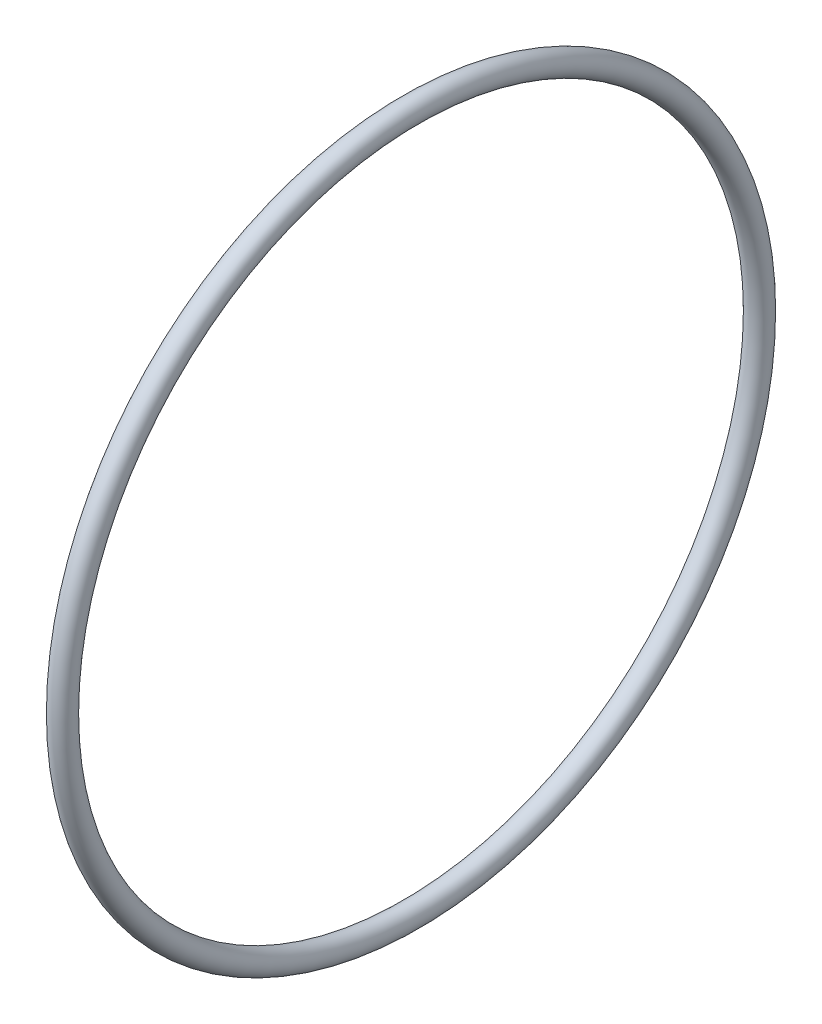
from build123d import *

# Parameters (mm, degrees)
SKETCH1_R = 1.7653


with BuildPart() as part:
    # Sketch1 → Revolve1 (revolve)
    with BuildSketch(Plane.XY, mode=Mode.PRIVATE) as revolve1_sk:
        with Locations((0, 53.9496)):
            Circle(SKETCH1_R)
    revolve(revolve1_sk.sketch.rotate(Axis((0, 0, 0), (-1, 0, 0)), 90), axis=Axis((0, 0, 0), (-1, 0, 0)))


solid = part.part
